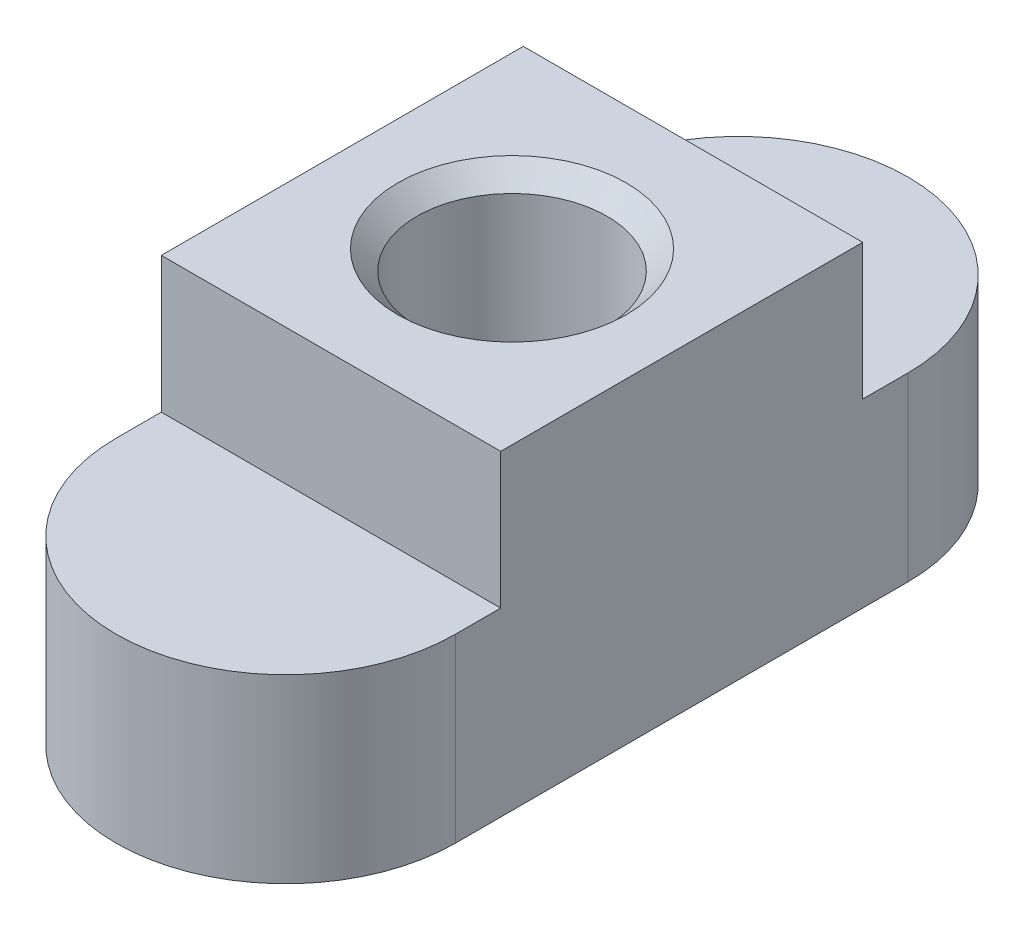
ISO-10303-21;
HEADER;
FILE_DESCRIPTION(('STEP AP214'),'2;1');
FILE_NAME('part.step','',(''),(''),'','','');
FILE_SCHEMA(('AUTOMOTIVE_DESIGN { 1 0 10303 214 1 1 1 1 }'));
ENDSEC;
DATA;
#1=APPLICATION_CONTEXT('core data for automotive mechanical design processes');
#2=APPLICATION_PROTOCOL_DEFINITION('international standard','automotive_design',2000,#1);
#3=PRODUCT_CONTEXT('',#1,'mechanical');
#4=PRODUCT('Part','Part','',(#3));
#5=PRODUCT_RELATED_PRODUCT_CATEGORY('part','',(#4));
#6=PRODUCT_DEFINITION_FORMATION('','',#4);
#7=PRODUCT_DEFINITION_CONTEXT('part definition',#1,'design');
#8=PRODUCT_DEFINITION('design','',#6,#7);
#9=PRODUCT_DEFINITION_SHAPE('','',#8);
#10=(LENGTH_UNIT() NAMED_UNIT(*) SI_UNIT(.MILLI.,.METRE.));
#11=(NAMED_UNIT(*) PLANE_ANGLE_UNIT() SI_UNIT($,.RADIAN.));
#12=(NAMED_UNIT(*) SI_UNIT($,.STERADIAN.) SOLID_ANGLE_UNIT());
#13=UNCERTAINTY_MEASURE_WITH_UNIT(LENGTH_MEASURE(1.E-05),#10,'distance_accuracy_value','');
#14=(GEOMETRIC_REPRESENTATION_CONTEXT(3) GLOBAL_UNCERTAINTY_ASSIGNED_CONTEXT((#13)) GLOBAL_UNIT_ASSIGNED_CONTEXT((#10,
#11,#12)) REPRESENTATION_CONTEXT('',''));
#15=CARTESIAN_POINT('',(0.,0.,0.));
#16=DIRECTION('',(0.,0.,1.));
#17=DIRECTION('',(1.,0.,0.));
#18=AXIS2_PLACEMENT_3D('',#15,#16,#17);
#19=CARTESIAN_POINT('',(0.,4.,5.));
#20=DIRECTION('',(0.,1.,0.));
#21=DIRECTION('',(0.,0.,1.));
#22=AXIS2_PLACEMENT_3D('',#19,#20,#21);
#23=PLANE('',#22);
#24=DIRECTION('',(1.,0.,0.));
#25=VECTOR('',#24,1.);
#26=CARTESIAN_POINT('',(-3.75,4.,4.));
#27=LINE('',#26,#25);
#28=CARTESIAN_POINT('',(-3.75,4.,4.));
#29=VERTEX_POINT('',#28);
#30=CARTESIAN_POINT('',(3.75,4.,4.));
#31=VERTEX_POINT('',#30);
#32=EDGE_CURVE('E52',#29,#31,#27,.T.);
#33=ORIENTED_EDGE('',*,*,#32,.F.);
#34=DIRECTION('',(0.,0.,1.));
#35=VECTOR('',#34,1.);
#36=CARTESIAN_POINT('',(-3.75,4.,5.));
#37=LINE('',#36,#35);
#38=CARTESIAN_POINT('',(-3.75,4.,5.));
#39=VERTEX_POINT('',#38);
#40=EDGE_CURVE('E142',#29,#39,#37,.T.);
#41=ORIENTED_EDGE('',*,*,#40,.T.);
#42=CARTESIAN_POINT('',(0.,4.,5.));
#43=DIRECTION('',(0.,1.,0.));
#44=DIRECTION('',(0.,0.,1.));
#45=AXIS2_PLACEMENT_3D('',#42,#43,#44);
#46=CIRCLE('',#45,3.75);
#47=CARTESIAN_POINT('',(3.75,4.,5.));
#48=VERTEX_POINT('',#47);
#49=EDGE_CURVE('E134',#39,#48,#46,.T.);
#50=ORIENTED_EDGE('',*,*,#49,.T.);
#51=DIRECTION('',(0.,0.,-1.));
#52=VECTOR('',#51,1.);
#53=CARTESIAN_POINT('',(3.75,4.,5.));
#54=LINE('',#53,#52);
#55=EDGE_CURVE('E138',#48,#31,#54,.T.);
#56=ORIENTED_EDGE('',*,*,#55,.T.);
#57=EDGE_LOOP('',(#33,#41,#50,#56));
#58=FACE_BOUND('',#57,.T.);
#59=ADVANCED_FACE('F37',(#58),#23,.T.);
#60=CARTESIAN_POINT('',(0.,4.,5.));
#61=DIRECTION('',(0.,-1.,0.));
#62=DIRECTION('',(0.,0.,-1.));
#63=AXIS2_PLACEMENT_3D('',#60,#61,#62);
#64=CYLINDRICAL_SURFACE('',#63,3.75);
#65=CARTESIAN_POINT('',(0.,0.,5.));
#66=DIRECTION('',(0.,1.,0.));
#67=DIRECTION('',(0.,0.,1.));
#68=AXIS2_PLACEMENT_3D('',#65,#66,#67);
#69=CIRCLE('',#68,3.75);
#70=CARTESIAN_POINT('',(-3.75,0.,5.));
#71=VERTEX_POINT('',#70);
#72=CARTESIAN_POINT('',(3.75,0.,5.));
#73=VERTEX_POINT('',#72);
#74=EDGE_CURVE('E125',#71,#73,#69,.T.);
#75=ORIENTED_EDGE('',*,*,#74,.T.);
#76=DIRECTION('',(0.,-1.,0.));
#77=VECTOR('',#76,1.);
#78=CARTESIAN_POINT('',(3.75,4.,5.));
#79=LINE('',#78,#77);
#80=EDGE_CURVE('E11',#48,#73,#79,.T.);
#81=ORIENTED_EDGE('',*,*,#80,.F.);
#82=ORIENTED_EDGE('',*,*,#49,.F.);
#83=DIRECTION('',(0.,-1.,0.));
#84=VECTOR('',#83,1.);
#85=CARTESIAN_POINT('',(-3.75,4.,5.));
#86=LINE('',#85,#84);
#87=EDGE_CURVE('E144',#39,#71,#86,.T.);
#88=ORIENTED_EDGE('',*,*,#87,.T.);
#89=EDGE_LOOP('',(#75,#81,#82,#88));
#90=FACE_BOUND('',#89,.T.);
#91=ADVANCED_FACE('F39',(#90),#64,.T.);
#92=CARTESIAN_POINT('',(3.75,4.,5.));
#93=DIRECTION('',(-1.,0.,0.));
#94=DIRECTION('',(0.,0.,1.));
#95=AXIS2_PLACEMENT_3D('',#92,#93,#94);
#96=PLANE('',#95);
#97=DIRECTION('',(0.,0.,-1.));
#98=VECTOR('',#97,1.);
#99=CARTESIAN_POINT('',(3.75,0.,5.));
#100=LINE('',#99,#98);
#101=CARTESIAN_POINT('',(3.75,0.,-5.));
#102=VERTEX_POINT('',#101);
#103=EDGE_CURVE('E128',#73,#102,#100,.T.);
#104=ORIENTED_EDGE('',*,*,#103,.T.);
#105=DIRECTION('',(0.,-1.,0.));
#106=VECTOR('',#105,1.);
#107=CARTESIAN_POINT('',(3.75,4.,-5.));
#108=LINE('',#107,#106);
#109=CARTESIAN_POINT('',(3.75,4.,-5.));
#110=VERTEX_POINT('',#109);
#111=EDGE_CURVE('E45',#110,#102,#108,.T.);
#112=ORIENTED_EDGE('',*,*,#111,.F.);
#113=CARTESIAN_POINT('',(3.75,4.,-4.));
#114=VERTEX_POINT('',#113);
#115=EDGE_CURVE('E124',#114,#110,#54,.T.);
#116=ORIENTED_EDGE('',*,*,#115,.F.);
#117=DIRECTION('',(0.,-1.,0.));
#118=VECTOR('',#117,1.);
#119=CARTESIAN_POINT('',(3.75,7.,-4.));
#120=LINE('',#119,#118);
#121=CARTESIAN_POINT('',(3.75,7.,-4.));
#122=VERTEX_POINT('',#121);
#123=EDGE_CURVE('E106',#122,#114,#120,.T.);
#124=ORIENTED_EDGE('',*,*,#123,.F.);
#125=DIRECTION('',(0.,0.,-1.));
#126=VECTOR('',#125,1.);
#127=CARTESIAN_POINT('',(3.75,7.,4.));
#128=LINE('',#127,#126);
#129=CARTESIAN_POINT('',(3.75,7.,4.));
#130=VERTEX_POINT('',#129);
#131=EDGE_CURVE('E112',#130,#122,#128,.T.);
#132=ORIENTED_EDGE('',*,*,#131,.F.);
#133=DIRECTION('',(0.,-1.,0.));
#134=VECTOR('',#133,1.);
#135=CARTESIAN_POINT('',(3.75,7.,4.));
#136=LINE('',#135,#134);
#137=EDGE_CURVE('E175',#130,#31,#136,.T.);
#138=ORIENTED_EDGE('',*,*,#137,.T.);
#139=ORIENTED_EDGE('',*,*,#55,.F.);
#140=ORIENTED_EDGE('',*,*,#80,.T.);
#141=EDGE_LOOP('',(#104,#112,#116,#124,#132,#138,#139,#140));
#142=FACE_BOUND('',#141,.T.);
#143=ADVANCED_FACE('F122',(#142),#96,.F.);
#144=CARTESIAN_POINT('',(0.,4.,-5.));
#145=DIRECTION('',(0.,-1.,0.));
#146=DIRECTION('',(0.,0.,-1.));
#147=AXIS2_PLACEMENT_3D('',#144,#145,#146);
#148=CYLINDRICAL_SURFACE('',#147,3.75);
#149=CARTESIAN_POINT('',(0.,0.,-5.));
#150=DIRECTION('',(0.,1.,0.));
#151=DIRECTION('',(0.,0.,1.));
#152=AXIS2_PLACEMENT_3D('',#149,#150,#151);
#153=CIRCLE('',#152,3.75);
#154=CARTESIAN_POINT('',(-3.75,0.,-5.));
#155=VERTEX_POINT('',#154);
#156=EDGE_CURVE('E147',#102,#155,#153,.T.);
#157=ORIENTED_EDGE('',*,*,#156,.T.);
#158=DIRECTION('',(0.,-1.,0.));
#159=VECTOR('',#158,1.);
#160=CARTESIAN_POINT('',(-3.75,4.,-5.));
#161=LINE('',#160,#159);
#162=CARTESIAN_POINT('',(-3.75,4.,-5.));
#163=VERTEX_POINT('',#162);
#164=EDGE_CURVE('E152',#163,#155,#161,.T.);
#165=ORIENTED_EDGE('',*,*,#164,.F.);
#166=CARTESIAN_POINT('',(0.,4.,-5.));
#167=DIRECTION('',(0.,1.,0.));
#168=DIRECTION('',(0.,0.,1.));
#169=AXIS2_PLACEMENT_3D('',#166,#167,#168);
#170=CIRCLE('',#169,3.75);
#171=EDGE_CURVE('E140',#110,#163,#170,.T.);
#172=ORIENTED_EDGE('',*,*,#171,.F.);
#173=ORIENTED_EDGE('',*,*,#111,.T.);
#174=EDGE_LOOP('',(#157,#165,#172,#173));
#175=FACE_BOUND('',#174,.T.);
#176=ADVANCED_FACE('F158',(#175),#148,.T.);
#177=CARTESIAN_POINT('',(-3.75,4.,5.));
#178=DIRECTION('',(1.,0.,0.));
#179=DIRECTION('',(0.,0.,-1.));
#180=AXIS2_PLACEMENT_3D('',#177,#178,#179);
#181=PLANE('',#180);
#182=DIRECTION('',(0.,0.,1.));
#183=VECTOR('',#182,1.);
#184=CARTESIAN_POINT('',(-3.75,0.,5.));
#185=LINE('',#184,#183);
#186=EDGE_CURVE('E137',#155,#71,#185,.T.);
#187=ORIENTED_EDGE('',*,*,#186,.T.);
#188=ORIENTED_EDGE('',*,*,#87,.F.);
#189=ORIENTED_EDGE('',*,*,#40,.F.);
#190=DIRECTION('',(0.,-1.,0.));
#191=VECTOR('',#190,1.);
#192=CARTESIAN_POINT('',(-3.75,7.,4.));
#193=LINE('',#192,#191);
#194=CARTESIAN_POINT('',(-3.75,7.,4.));
#195=VERTEX_POINT('',#194);
#196=EDGE_CURVE('E130',#195,#29,#193,.T.);
#197=ORIENTED_EDGE('',*,*,#196,.F.);
#198=DIRECTION('',(0.,0.,1.));
#199=VECTOR('',#198,1.);
#200=CARTESIAN_POINT('',(-3.75,7.,4.));
#201=LINE('',#200,#199);
#202=CARTESIAN_POINT('',(-3.75,7.,-4.));
#203=VERTEX_POINT('',#202);
#204=EDGE_CURVE('E111',#203,#195,#201,.T.);
#205=ORIENTED_EDGE('',*,*,#204,.F.);
#206=DIRECTION('',(0.,-1.,0.));
#207=VECTOR('',#206,1.);
#208=CARTESIAN_POINT('',(-3.75,7.,-4.));
#209=LINE('',#208,#207);
#210=CARTESIAN_POINT('',(-3.75,4.,-4.));
#211=VERTEX_POINT('',#210);
#212=EDGE_CURVE('E108',#203,#211,#209,.T.);
#213=ORIENTED_EDGE('',*,*,#212,.T.);
#214=EDGE_CURVE('E143',#163,#211,#37,.T.);
#215=ORIENTED_EDGE('',*,*,#214,.F.);
#216=ORIENTED_EDGE('',*,*,#164,.T.);
#217=EDGE_LOOP('',(#187,#188,#189,#197,#205,#213,#215,#216));
#218=FACE_BOUND('',#217,.T.);
#219=ADVANCED_FACE('F166',(#218),#181,.F.);
#220=DIRECTION('',(-1.,0.,0.));
#221=VECTOR('',#220,1.);
#222=CARTESIAN_POINT('',(-3.75,4.,-4.));
#223=LINE('',#222,#221);
#224=EDGE_CURVE('E60',#114,#211,#223,.T.);
#225=ORIENTED_EDGE('',*,*,#224,.F.);
#226=ORIENTED_EDGE('',*,*,#115,.T.);
#227=ORIENTED_EDGE('',*,*,#171,.T.);
#228=ORIENTED_EDGE('',*,*,#214,.T.);
#229=EDGE_LOOP('',(#225,#226,#227,#228));
#230=FACE_BOUND('',#229,.T.);
#231=ADVANCED_FACE('F206',(#230),#23,.T.);
#232=CARTESIAN_POINT('',(0.,0.,5.));
#233=DIRECTION('',(0.,1.,0.));
#234=DIRECTION('',(0.,0.,1.));
#235=AXIS2_PLACEMENT_3D('',#232,#233,#234);
#236=PLANE('',#235);
#237=CARTESIAN_POINT('',(0.,0.,0.));
#238=DIRECTION('',(0.,1.,0.));
#239=DIRECTION('',(0.,0.,1.));
#240=AXIS2_PLACEMENT_3D('',#237,#238,#239);
#241=CIRCLE('',#240,2.1);
#242=CARTESIAN_POINT('',(0.,0.,2.1));
#243=VERTEX_POINT('',#242);
#244=EDGE_CURVE('E180',#243,#243,#241,.T.);
#245=ORIENTED_EDGE('',*,*,#244,.T.);
#246=EDGE_LOOP('',(#245));
#247=FACE_BOUND('',#246,.T.);
#248=ORIENTED_EDGE('',*,*,#74,.F.);
#249=ORIENTED_EDGE('',*,*,#186,.F.);
#250=ORIENTED_EDGE('',*,*,#156,.F.);
#251=ORIENTED_EDGE('',*,*,#103,.F.);
#252=EDGE_LOOP('',(#248,#249,#250,#251));
#253=FACE_BOUND('',#252,.T.);
#254=ADVANCED_FACE('F163',(#247,#253),#236,.F.);
#255=CARTESIAN_POINT('',(-3.75,7.,-4.));
#256=DIRECTION('',(0.,0.,1.));
#257=DIRECTION('',(1.,0.,0.));
#258=AXIS2_PLACEMENT_3D('',#255,#256,#257);
#259=PLANE('',#258);
#260=ORIENTED_EDGE('',*,*,#224,.T.);
#261=ORIENTED_EDGE('',*,*,#212,.F.);
#262=DIRECTION('',(-1.,0.,0.));
#263=VECTOR('',#262,1.);
#264=CARTESIAN_POINT('',(-3.75,7.,-4.));
#265=LINE('',#264,#263);
#266=EDGE_CURVE('E102',#122,#203,#265,.T.);
#267=ORIENTED_EDGE('',*,*,#266,.F.);
#268=ORIENTED_EDGE('',*,*,#123,.T.);
#269=EDGE_LOOP('',(#260,#261,#267,#268));
#270=FACE_BOUND('',#269,.T.);
#271=ADVANCED_FACE('F104',(#270),#259,.F.);
#272=CARTESIAN_POINT('',(-3.75,7.,4.));
#273=DIRECTION('',(0.,0.,-1.));
#274=DIRECTION('',(-1.,0.,0.));
#275=AXIS2_PLACEMENT_3D('',#272,#273,#274);
#276=PLANE('',#275);
#277=ORIENTED_EDGE('',*,*,#32,.T.);
#278=ORIENTED_EDGE('',*,*,#137,.F.);
#279=DIRECTION('',(1.,0.,0.));
#280=VECTOR('',#279,1.);
#281=CARTESIAN_POINT('',(-3.75,7.,4.));
#282=LINE('',#281,#280);
#283=EDGE_CURVE('E117',#195,#130,#282,.T.);
#284=ORIENTED_EDGE('',*,*,#283,.F.);
#285=ORIENTED_EDGE('',*,*,#196,.T.);
#286=EDGE_LOOP('',(#277,#278,#284,#285));
#287=FACE_BOUND('',#286,.T.);
#288=ADVANCED_FACE('F174',(#287),#276,.F.);
#289=CARTESIAN_POINT('',(0.,7.,0.));
#290=DIRECTION('',(0.,-1.,0.));
#291=DIRECTION('',(0.,0.,-1.));
#292=AXIS2_PLACEMENT_3D('',#289,#290,#291);
#293=PLANE('',#292);
#294=CARTESIAN_POINT('',(0.,7.,0.));
#295=DIRECTION('',(0.,1.,0.));
#296=DIRECTION('',(0.,0.,1.));
#297=AXIS2_PLACEMENT_3D('',#294,#295,#296);
#298=CIRCLE('',#297,2.525);
#299=CARTESIAN_POINT('',(0.,7.,2.525));
#300=VERTEX_POINT('',#299);
#301=EDGE_CURVE('E188',#300,#300,#298,.T.);
#302=ORIENTED_EDGE('',*,*,#301,.F.);
#303=EDGE_LOOP('',(#302));
#304=FACE_BOUND('',#303,.T.);
#305=ORIENTED_EDGE('',*,*,#131,.T.);
#306=ORIENTED_EDGE('',*,*,#266,.T.);
#307=ORIENTED_EDGE('',*,*,#204,.T.);
#308=ORIENTED_EDGE('',*,*,#283,.T.);
#309=EDGE_LOOP('',(#305,#306,#307,#308));
#310=FACE_BOUND('',#309,.T.);
#311=ADVANCED_FACE('F115',(#304,#310),#293,.F.);
#312=CARTESIAN_POINT('',(0.,7.,0.));
#313=DIRECTION('',(0.,1.,0.));
#314=DIRECTION('',(0.,0.,1.));
#315=AXIS2_PLACEMENT_3D('',#312,#313,#314);
#316=CYLINDRICAL_SURFACE('',#315,2.1);
#317=ORIENTED_EDGE('',*,*,#244,.F.);
#318=EDGE_LOOP('',(#317));
#319=FACE_BOUND('',#318,.T.);
#320=CARTESIAN_POINT('',(0.,6.575,0.));
#321=DIRECTION('',(0.,1.,0.));
#322=DIRECTION('',(0.,0.,1.));
#323=AXIS2_PLACEMENT_3D('',#320,#321,#322);
#324=CIRCLE('',#323,2.1);
#325=CARTESIAN_POINT('',(0.,6.575,2.1));
#326=VERTEX_POINT('',#325);
#327=EDGE_CURVE('E185',#326,#326,#324,.T.);
#328=ORIENTED_EDGE('',*,*,#327,.T.);
#329=EDGE_LOOP('',(#328));
#330=FACE_BOUND('',#329,.T.);
#331=ADVANCED_FACE('F195',(#319,#330),#316,.F.);
#332=CARTESIAN_POINT('',(0.,7.,0.));
#333=DIRECTION('',(0.,1.,0.));
#334=DIRECTION('',(0.,0.,1.));
#335=AXIS2_PLACEMENT_3D('',#332,#333,#334);
#336=CONICAL_SURFACE('',#335,2.525,0.785398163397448);
#337=ORIENTED_EDGE('',*,*,#327,.F.);
#338=EDGE_LOOP('',(#337));
#339=FACE_BOUND('',#338,.T.);
#340=ORIENTED_EDGE('',*,*,#301,.T.);
#341=EDGE_LOOP('',(#340));
#342=FACE_BOUND('',#341,.T.);
#343=ADVANCED_FACE('F192',(#339,#342),#336,.F.);
#344=CLOSED_SHELL('',(#59,#91,#143,#176,#219,#231,#254,#271,#288,#311,#331,#343));
#345=MANIFOLD_SOLID_BREP('B2',#344);
#346=ADVANCED_BREP_SHAPE_REPRESENTATION('',(#18,#345),#14);
#347=SHAPE_DEFINITION_REPRESENTATION(#9,#346);
ENDSEC;
END-ISO-10303-21;
